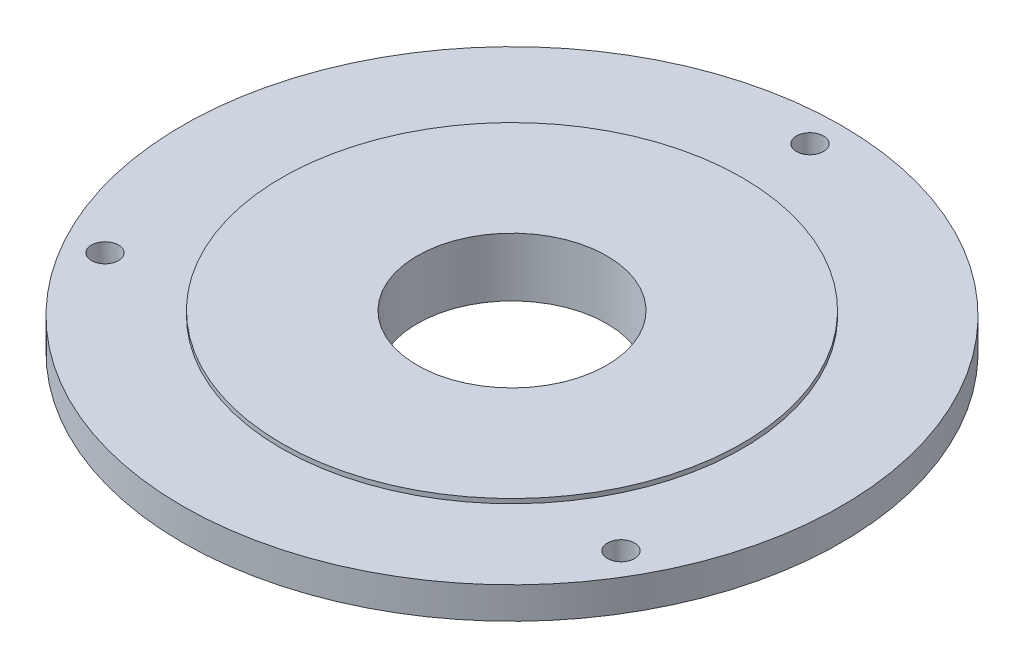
ISO-10303-21;
HEADER;
FILE_DESCRIPTION(('STEP AP214'),'2;1');
FILE_NAME('part.step','',(''),(''),'','','');
FILE_SCHEMA(('AUTOMOTIVE_DESIGN { 1 0 10303 214 1 1 1 1 }'));
ENDSEC;
DATA;
#1=APPLICATION_CONTEXT('core data for automotive mechanical design processes');
#2=APPLICATION_PROTOCOL_DEFINITION('international standard','automotive_design',2000,#1);
#3=PRODUCT_CONTEXT('',#1,'mechanical');
#4=PRODUCT('Part','Part','',(#3));
#5=PRODUCT_RELATED_PRODUCT_CATEGORY('part','',(#4));
#6=PRODUCT_DEFINITION_FORMATION('','',#4);
#7=PRODUCT_DEFINITION_CONTEXT('part definition',#1,'design');
#8=PRODUCT_DEFINITION('design','',#6,#7);
#9=PRODUCT_DEFINITION_SHAPE('','',#8);
#10=(LENGTH_UNIT() NAMED_UNIT(*) SI_UNIT(.MILLI.,.METRE.));
#11=(NAMED_UNIT(*) PLANE_ANGLE_UNIT() SI_UNIT($,.RADIAN.));
#12=(NAMED_UNIT(*) SI_UNIT($,.STERADIAN.) SOLID_ANGLE_UNIT());
#13=UNCERTAINTY_MEASURE_WITH_UNIT(LENGTH_MEASURE(1.E-05),#10,'distance_accuracy_value','');
#14=(GEOMETRIC_REPRESENTATION_CONTEXT(3) GLOBAL_UNCERTAINTY_ASSIGNED_CONTEXT((#13)) GLOBAL_UNIT_ASSIGNED_CONTEXT((#10,
#11,#12)) REPRESENTATION_CONTEXT('',''));
#15=CARTESIAN_POINT('',(0.,0.,0.));
#16=DIRECTION('',(0.,0.,1.));
#17=DIRECTION('',(1.,0.,0.));
#18=AXIS2_PLACEMENT_3D('',#15,#16,#17);
#19=CARTESIAN_POINT('',(0.,0.,0.));
#20=DIRECTION('',(0.,-1.,0.));
#21=DIRECTION('',(0.,0.,-1.));
#22=AXIS2_PLACEMENT_3D('',#19,#20,#21);
#23=CYLINDRICAL_SURFACE('',#22,25.5);
#24=CARTESIAN_POINT('',(0.,38.3859311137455,0.));
#25=DIRECTION('',(0.,-1.,0.));
#26=DIRECTION('',(0.,0.,-1.));
#27=AXIS2_PLACEMENT_3D('',#24,#25,#26);
#28=CIRCLE('',#27,25.5);
#29=CARTESIAN_POINT('',(0.,38.3859311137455,-25.5));
#30=VERTEX_POINT('',#29);
#31=EDGE_CURVE('E10',#30,#30,#28,.T.);
#32=ORIENTED_EDGE('',*,*,#31,.T.);
#33=EDGE_LOOP('',(#32));
#34=FACE_BOUND('',#33,.T.);
#35=CARTESIAN_POINT('',(0.,37.8859311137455,0.));
#36=DIRECTION('',(0.,-1.,0.));
#37=DIRECTION('',(0.,0.,-1.));
#38=AXIS2_PLACEMENT_3D('',#35,#36,#37);
#39=CIRCLE('',#38,25.5);
#40=CARTESIAN_POINT('',(0.,37.8859311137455,-25.5));
#41=VERTEX_POINT('',#40);
#42=EDGE_CURVE('E72',#41,#41,#39,.T.);
#43=ORIENTED_EDGE('',*,*,#42,.F.);
#44=EDGE_LOOP('',(#43));
#45=FACE_BOUND('',#44,.T.);
#46=ADVANCED_FACE('F37',(#34,#45),#23,.T.);
#47=CARTESIAN_POINT('',(10.5,38.3859311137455,0.));
#48=DIRECTION('',(0.,1.,0.));
#49=DIRECTION('',(0.,0.,1.));
#50=AXIS2_PLACEMENT_3D('',#47,#48,#49);
#51=PLANE('',#50);
#52=CARTESIAN_POINT('',(0.,38.3859311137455,0.));
#53=DIRECTION('',(0.,-1.,0.));
#54=DIRECTION('',(0.,0.,-1.));
#55=AXIS2_PLACEMENT_3D('',#52,#53,#54);
#56=CIRCLE('',#55,10.5);
#57=CARTESIAN_POINT('',(0.,38.3859311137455,-10.5));
#58=VERTEX_POINT('',#57);
#59=EDGE_CURVE('E44',#58,#58,#56,.T.);
#60=ORIENTED_EDGE('',*,*,#59,.T.);
#61=EDGE_LOOP('',(#60));
#62=FACE_BOUND('',#61,.T.);
#63=ORIENTED_EDGE('',*,*,#31,.F.);
#64=EDGE_LOOP('',(#63));
#65=FACE_BOUND('',#64,.T.);
#66=ADVANCED_FACE('F144',(#62,#65),#51,.T.);
#67=CARTESIAN_POINT('',(0.,0.,0.));
#68=DIRECTION('',(0.,-1.,0.));
#69=DIRECTION('',(0.,0.,-1.));
#70=AXIS2_PLACEMENT_3D('',#67,#68,#69);
#71=CYLINDRICAL_SURFACE('',#70,10.5);
#72=CARTESIAN_POINT('',(0.,31.8859311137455,0.));
#73=DIRECTION('',(0.,-1.,0.));
#74=DIRECTION('',(0.,0.,-1.));
#75=AXIS2_PLACEMENT_3D('',#72,#73,#74);
#76=CIRCLE('',#75,10.5);
#77=CARTESIAN_POINT('',(0.,31.8859311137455,-10.5));
#78=VERTEX_POINT('',#77);
#79=EDGE_CURVE('E49',#78,#78,#76,.T.);
#80=ORIENTED_EDGE('',*,*,#79,.T.);
#81=EDGE_LOOP('',(#80));
#82=FACE_BOUND('',#81,.T.);
#83=ORIENTED_EDGE('',*,*,#59,.F.);
#84=EDGE_LOOP('',(#83));
#85=FACE_BOUND('',#84,.T.);
#86=ADVANCED_FACE('F138',(#82,#85),#71,.F.);
#87=CARTESIAN_POINT('',(10.5,31.8859311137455,0.));
#88=DIRECTION('',(0.,-1.,0.));
#89=DIRECTION('',(0.,0.,-1.));
#90=AXIS2_PLACEMENT_3D('',#87,#88,#89);
#91=PLANE('',#90);
#92=CARTESIAN_POINT('',(0.,31.8859311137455,0.));
#93=DIRECTION('',(0.,-1.,0.));
#94=DIRECTION('',(0.,0.,-1.));
#95=AXIS2_PLACEMENT_3D('',#92,#93,#94);
#96=CIRCLE('',#95,14.25);
#97=CARTESIAN_POINT('',(0.,31.8859311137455,-14.25));
#98=VERTEX_POINT('',#97);
#99=EDGE_CURVE('E54',#98,#98,#96,.T.);
#100=ORIENTED_EDGE('',*,*,#99,.T.);
#101=EDGE_LOOP('',(#100));
#102=FACE_BOUND('',#101,.T.);
#103=ORIENTED_EDGE('',*,*,#79,.F.);
#104=EDGE_LOOP('',(#103));
#105=FACE_BOUND('',#104,.T.);
#106=ADVANCED_FACE('F132',(#102,#105),#91,.T.);
#107=CARTESIAN_POINT('',(0.,0.,0.));
#108=DIRECTION('',(0.,-1.,0.));
#109=DIRECTION('',(0.,0.,-1.));
#110=AXIS2_PLACEMENT_3D('',#107,#108,#109);
#111=CYLINDRICAL_SURFACE('',#110,14.25);
#112=CARTESIAN_POINT('',(0.,34.3859311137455,0.));
#113=DIRECTION('',(0.,-1.,0.));
#114=DIRECTION('',(0.,0.,-1.));
#115=AXIS2_PLACEMENT_3D('',#112,#113,#114);
#116=CIRCLE('',#115,14.25);
#117=CARTESIAN_POINT('',(0.,34.3859311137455,-14.25));
#118=VERTEX_POINT('',#117);
#119=EDGE_CURVE('E60',#118,#118,#116,.T.);
#120=ORIENTED_EDGE('',*,*,#119,.T.);
#121=EDGE_LOOP('',(#120));
#122=FACE_BOUND('',#121,.T.);
#123=ORIENTED_EDGE('',*,*,#99,.F.);
#124=EDGE_LOOP('',(#123));
#125=FACE_BOUND('',#124,.T.);
#126=ADVANCED_FACE('F125',(#122,#125),#111,.T.);
#127=CARTESIAN_POINT('',(14.25,34.3859311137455,0.));
#128=DIRECTION('',(0.,-1.,0.));
#129=DIRECTION('',(0.,0.,-1.));
#130=AXIS2_PLACEMENT_3D('',#127,#128,#129);
#131=PLANE('',#130);
#132=CARTESIAN_POINT('',(0.,34.3859311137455,-33.));
#133=DIRECTION('',(0.,-1.,0.));
#134=DIRECTION('',(0.,0.,-1.));
#135=AXIS2_PLACEMENT_3D('',#132,#133,#134);
#136=CIRCLE('',#135,1.5);
#137=CARTESIAN_POINT('',(0.,34.3859311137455,-34.5));
#138=VERTEX_POINT('',#137);
#139=EDGE_CURVE('E76',#138,#138,#136,.T.);
#140=ORIENTED_EDGE('',*,*,#139,.F.);
#141=EDGE_LOOP('',(#140));
#142=FACE_BOUND('',#141,.T.);
#143=CARTESIAN_POINT('',(28.5788383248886,34.3859311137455,16.4999999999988));
#144=DIRECTION('',(0.,-1.,0.));
#145=DIRECTION('',(0.,0.,-1.));
#146=AXIS2_PLACEMENT_3D('',#143,#144,#145);
#147=CIRCLE('',#146,1.5000000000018);
#148=CARTESIAN_POINT('',(28.5788383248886,34.3859311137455,14.999999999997));
#149=VERTEX_POINT('',#148);
#150=EDGE_CURVE('E80',#149,#149,#147,.T.);
#151=ORIENTED_EDGE('',*,*,#150,.F.);
#152=EDGE_LOOP('',(#151));
#153=FACE_BOUND('',#152,.T.);
#154=CARTESIAN_POINT('',(-28.5788383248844,34.3859311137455,16.5000000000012));
#155=DIRECTION('',(0.,-1.,0.));
#156=DIRECTION('',(0.,0.,-1.));
#157=AXIS2_PLACEMENT_3D('',#154,#155,#156);
#158=CIRCLE('',#157,1.50000000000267);
#159=CARTESIAN_POINT('',(-28.5788383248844,34.3859311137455,14.9999999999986));
#160=VERTEX_POINT('',#159);
#161=EDGE_CURVE('E84',#160,#160,#158,.T.);
#162=ORIENTED_EDGE('',*,*,#161,.F.);
#163=EDGE_LOOP('',(#162));
#164=FACE_BOUND('',#163,.T.);
#165=CARTESIAN_POINT('',(0.,34.3859311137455,0.));
#166=DIRECTION('',(0.,-1.,0.));
#167=DIRECTION('',(0.,0.,-1.));
#168=AXIS2_PLACEMENT_3D('',#165,#166,#167);
#169=CIRCLE('',#168,36.5);
#170=CARTESIAN_POINT('',(0.,34.3859311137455,-36.5));
#171=VERTEX_POINT('',#170);
#172=EDGE_CURVE('E64',#171,#171,#169,.T.);
#173=ORIENTED_EDGE('',*,*,#172,.T.);
#174=EDGE_LOOP('',(#173));
#175=FACE_BOUND('',#174,.T.);
#176=ORIENTED_EDGE('',*,*,#119,.F.);
#177=EDGE_LOOP('',(#176));
#178=FACE_BOUND('',#177,.T.);
#179=ADVANCED_FACE('F119',(#142,#153,#164,#175,#178),#131,.T.);
#180=CARTESIAN_POINT('',(0.,0.,0.));
#181=DIRECTION('',(0.,-1.,0.));
#182=DIRECTION('',(0.,0.,-1.));
#183=AXIS2_PLACEMENT_3D('',#180,#181,#182);
#184=CYLINDRICAL_SURFACE('',#183,36.5);
#185=CARTESIAN_POINT('',(0.,37.8859311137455,0.));
#186=DIRECTION('',(0.,-1.,0.));
#187=DIRECTION('',(0.,0.,-1.));
#188=AXIS2_PLACEMENT_3D('',#185,#186,#187);
#189=CIRCLE('',#188,36.5);
#190=CARTESIAN_POINT('',(0.,37.8859311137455,-36.5));
#191=VERTEX_POINT('',#190);
#192=EDGE_CURVE('E68',#191,#191,#189,.T.);
#193=ORIENTED_EDGE('',*,*,#192,.T.);
#194=EDGE_LOOP('',(#193));
#195=FACE_BOUND('',#194,.T.);
#196=ORIENTED_EDGE('',*,*,#172,.F.);
#197=EDGE_LOOP('',(#196));
#198=FACE_BOUND('',#197,.T.);
#199=ADVANCED_FACE('F107',(#195,#198),#184,.T.);
#200=CARTESIAN_POINT('',(25.5,37.8859311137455,0.));
#201=DIRECTION('',(0.,1.,0.));
#202=DIRECTION('',(0.,0.,1.));
#203=AXIS2_PLACEMENT_3D('',#200,#201,#202);
#204=PLANE('',#203);
#205=CARTESIAN_POINT('',(0.,37.8859311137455,-33.));
#206=DIRECTION('',(0.,1.,0.));
#207=DIRECTION('',(0.,0.,1.));
#208=AXIS2_PLACEMENT_3D('',#205,#206,#207);
#209=CIRCLE('',#208,1.5);
#210=CARTESIAN_POINT('',(0.,37.8859311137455,-31.5));
#211=VERTEX_POINT('',#210);
#212=EDGE_CURVE('E88',#211,#211,#209,.T.);
#213=ORIENTED_EDGE('',*,*,#212,.F.);
#214=EDGE_LOOP('',(#213));
#215=FACE_BOUND('',#214,.T.);
#216=CARTESIAN_POINT('',(28.5788383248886,37.8859311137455,16.4999999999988));
#217=DIRECTION('',(0.,1.,0.));
#218=DIRECTION('',(0.,0.,1.));
#219=AXIS2_PLACEMENT_3D('',#216,#217,#218);
#220=CIRCLE('',#219,1.5000000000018);
#221=CARTESIAN_POINT('',(28.5788383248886,37.8859311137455,18.0000000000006));
#222=VERTEX_POINT('',#221);
#223=EDGE_CURVE('E93',#222,#222,#220,.T.);
#224=ORIENTED_EDGE('',*,*,#223,.F.);
#225=EDGE_LOOP('',(#224));
#226=FACE_BOUND('',#225,.T.);
#227=CARTESIAN_POINT('',(-28.5788383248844,37.8859311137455,16.5000000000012));
#228=DIRECTION('',(0.,1.,0.));
#229=DIRECTION('',(0.,0.,1.));
#230=AXIS2_PLACEMENT_3D('',#227,#228,#229);
#231=CIRCLE('',#230,1.50000000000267);
#232=CARTESIAN_POINT('',(-28.5788383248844,37.8859311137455,18.0000000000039));
#233=VERTEX_POINT('',#232);
#234=EDGE_CURVE('E89',#233,#233,#231,.T.);
#235=ORIENTED_EDGE('',*,*,#234,.F.);
#236=EDGE_LOOP('',(#235));
#237=FACE_BOUND('',#236,.T.);
#238=ORIENTED_EDGE('',*,*,#42,.T.);
#239=EDGE_LOOP('',(#238));
#240=FACE_BOUND('',#239,.T.);
#241=ORIENTED_EDGE('',*,*,#192,.F.);
#242=EDGE_LOOP('',(#241));
#243=FACE_BOUND('',#242,.T.);
#244=ADVANCED_FACE('F103',(#215,#226,#237,#240,#243),#204,.T.);
#245=CARTESIAN_POINT('',(-28.5788383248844,31.8859311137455,16.5000000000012));
#246=DIRECTION('',(0.,1.,0.));
#247=DIRECTION('',(0.,0.,1.));
#248=AXIS2_PLACEMENT_3D('',#245,#246,#247);
#249=CYLINDRICAL_SURFACE('',#248,1.50000000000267);
#250=ORIENTED_EDGE('',*,*,#161,.T.);
#251=EDGE_LOOP('',(#250));
#252=FACE_BOUND('',#251,.T.);
#253=ORIENTED_EDGE('',*,*,#234,.T.);
#254=EDGE_LOOP('',(#253));
#255=FACE_BOUND('',#254,.T.);
#256=ADVANCED_FACE('F106',(#252,#255),#249,.F.);
#257=CARTESIAN_POINT('',(28.5788383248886,31.8859311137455,16.4999999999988));
#258=DIRECTION('',(0.,1.,0.));
#259=DIRECTION('',(0.,0.,1.));
#260=AXIS2_PLACEMENT_3D('',#257,#258,#259);
#261=CYLINDRICAL_SURFACE('',#260,1.5000000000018);
#262=ORIENTED_EDGE('',*,*,#150,.T.);
#263=EDGE_LOOP('',(#262));
#264=FACE_BOUND('',#263,.T.);
#265=ORIENTED_EDGE('',*,*,#223,.T.);
#266=EDGE_LOOP('',(#265));
#267=FACE_BOUND('',#266,.T.);
#268=ADVANCED_FACE('F200',(#264,#267),#261,.F.);
#269=CARTESIAN_POINT('',(0.,31.8859311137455,-33.));
#270=DIRECTION('',(0.,1.,0.));
#271=DIRECTION('',(0.,0.,1.));
#272=AXIS2_PLACEMENT_3D('',#269,#270,#271);
#273=CYLINDRICAL_SURFACE('',#272,1.5);
#274=ORIENTED_EDGE('',*,*,#139,.T.);
#275=EDGE_LOOP('',(#274));
#276=FACE_BOUND('',#275,.T.);
#277=ORIENTED_EDGE('',*,*,#212,.T.);
#278=EDGE_LOOP('',(#277));
#279=FACE_BOUND('',#278,.T.);
#280=ADVANCED_FACE('F101',(#276,#279),#273,.F.);
#281=CLOSED_SHELL('',(#46,#66,#86,#106,#126,#179,#199,#244,#256,#268,#280));
#282=MANIFOLD_SOLID_BREP('B2',#281);
#283=ADVANCED_BREP_SHAPE_REPRESENTATION('',(#18,#282),#14);
#284=SHAPE_DEFINITION_REPRESENTATION(#9,#283);
ENDSEC;
END-ISO-10303-21;
